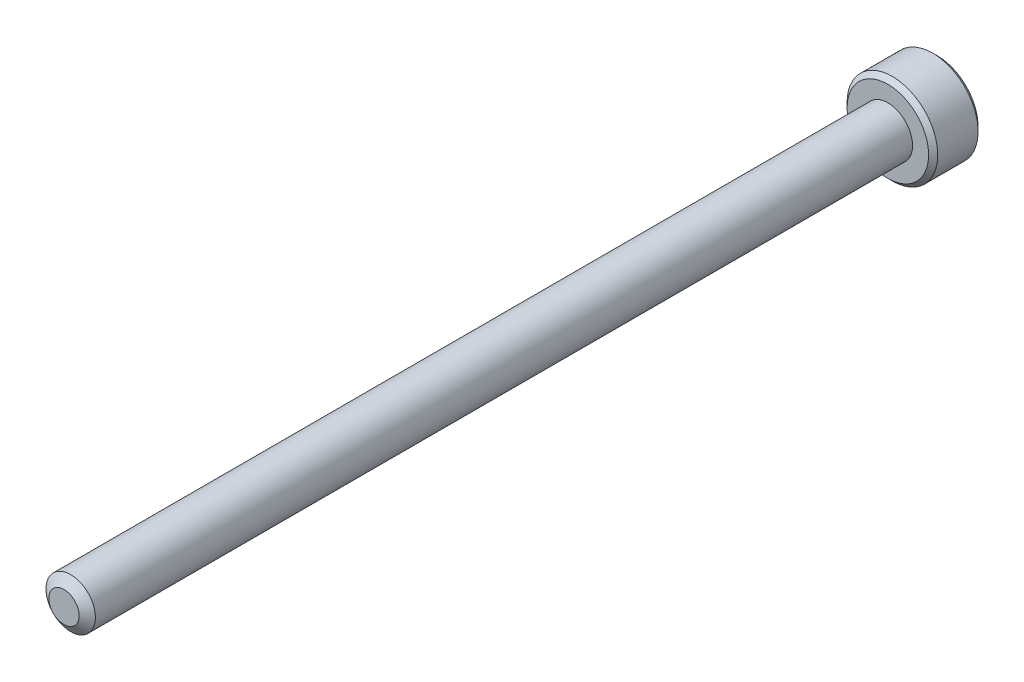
from build123d import *

# Parameters (mm, degrees)
SKETCH1_R          = 1.5
EXTRUDE1_DEPTH     = 50
SKETCH6_R          = 2.75
EXTRUDE2_DEPTH     = 3
CUT_EXTRUDE1_DEPTH = 1.875
CHAMFER1_SIZE      = 0.275


with BuildPart() as part:
    # Sketch1 → Extrude1 (new body)
    with BuildSketch(Plane.XY):
        Circle(SKETCH1_R)
    extrude(amount=-EXTRUDE1_DEPTH)

    # Sketch4 → Cut-Revolve1 (revolve, cut)
    with BuildSketch(Plane(origin=(0, 0, 0), x_dir=(0, 0, -1), z_dir=(1, 0, 0)), mode=Mode.PRIVATE) as cut_revolve1_sk:
        Polygon((0.405251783, 1.5), (0, 0.921240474), (0, 1.5), align=None)
    revolve(cut_revolve1_sk.sketch.rotate(Axis((0, 0, 0), (0, 0, -1)), 90), axis=Axis((0, 0, 0), (0, 0, -1)), mode=Mode.SUBTRACT)

    # Sketch6 → Extrude2 (add)
    with BuildSketch(Plane(origin=(0, 0, -50), x_dir=(-1, 0, 0), z_dir=(0, 0, -1))):
        Circle(SKETCH6_R)
    extrude(amount=EXTRUDE2_DEPTH)

    # Sketch7 → Cut-Extrude1 (cut)
    with BuildSketch(Plane(origin=(0, 0, -53), x_dir=(-1, 0, 0), z_dir=(0, 0, -1))):
        Polygon((0, 1.443375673), (-1.25, 0.721687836), (-1.25, -0.721687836), (0, -1.443375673), (1.25, -0.721687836), (1.25, 0.721687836), align=None)
    extrude(amount=-CUT_EXTRUDE1_DEPTH, mode=Mode.SUBTRACT)

    # Cut-Extrude2 cone 1 section (on through the dimple's axis) → Cut-Extrude2 (revolve, cut)
    with BuildSketch(Plane(origin=(0, 0, -53), x_dir=(0, 1, 0), z_dir=(1, 0, 0))):
        Polygon((0, 0), (1.443375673, 0), (0, 1.443375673), align=None)
    revolve(axis=Axis((0, 0, -53), (0, 0, 1)), mode=Mode.SUBTRACT)

    # Chamfer1
    chamfer1_edges = [part.edges().sort_by_distance(p)[0] for p in [
        (2.75, 0, -50),
        (2.75, 0, -53),
    ]]
    chamfer(chamfer1_edges, length=CHAMFER1_SIZE)


solid = part.part
